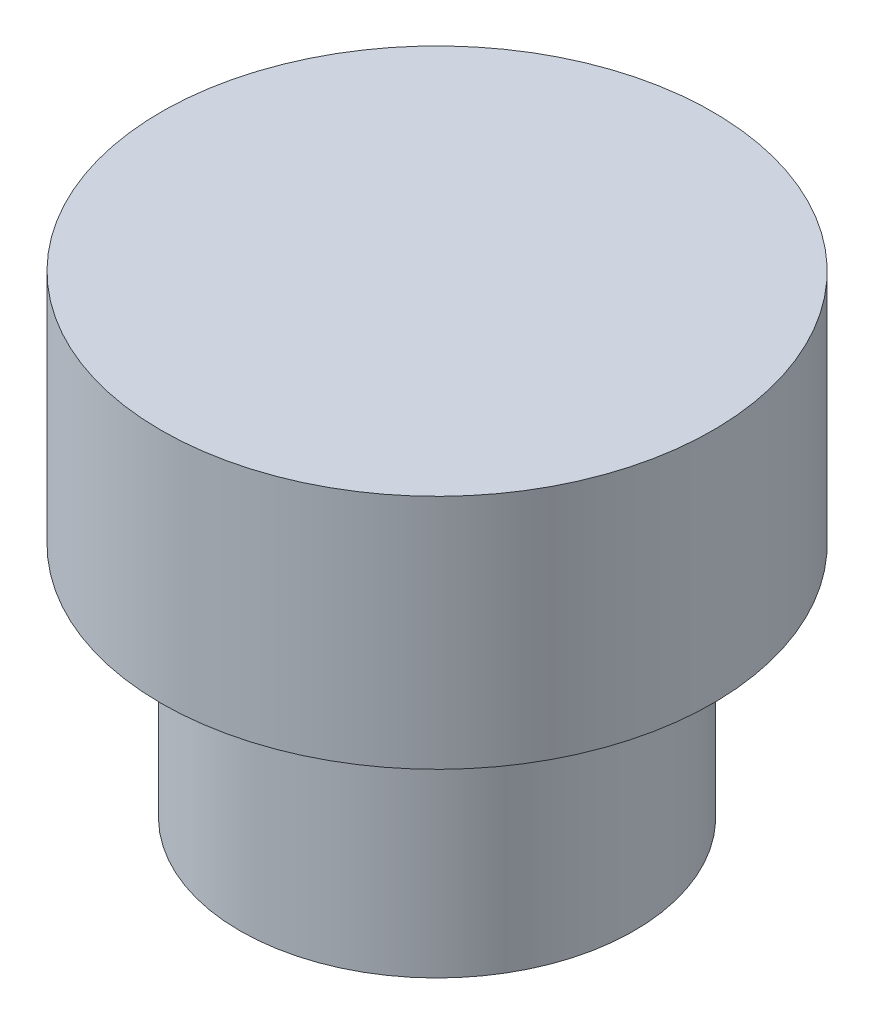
ISO-10303-21;
HEADER;
FILE_DESCRIPTION(('STEP AP214'),'2;1');
FILE_NAME('part.step','',(''),(''),'','','');
FILE_SCHEMA(('AUTOMOTIVE_DESIGN { 1 0 10303 214 1 1 1 1 }'));
ENDSEC;
DATA;
#1=APPLICATION_CONTEXT('core data for automotive mechanical design processes');
#2=APPLICATION_PROTOCOL_DEFINITION('international standard','automotive_design',2000,#1);
#3=PRODUCT_CONTEXT('',#1,'mechanical');
#4=PRODUCT('Part','Part','',(#3));
#5=PRODUCT_RELATED_PRODUCT_CATEGORY('part','',(#4));
#6=PRODUCT_DEFINITION_FORMATION('','',#4);
#7=PRODUCT_DEFINITION_CONTEXT('part definition',#1,'design');
#8=PRODUCT_DEFINITION('design','',#6,#7);
#9=PRODUCT_DEFINITION_SHAPE('','',#8);
#10=(LENGTH_UNIT() NAMED_UNIT(*) SI_UNIT(.MILLI.,.METRE.));
#11=(NAMED_UNIT(*) PLANE_ANGLE_UNIT() SI_UNIT($,.RADIAN.));
#12=(NAMED_UNIT(*) SI_UNIT($,.STERADIAN.) SOLID_ANGLE_UNIT());
#13=UNCERTAINTY_MEASURE_WITH_UNIT(LENGTH_MEASURE(1.E-05),#10,'distance_accuracy_value','');
#14=(GEOMETRIC_REPRESENTATION_CONTEXT(3) GLOBAL_UNCERTAINTY_ASSIGNED_CONTEXT((#13)) GLOBAL_UNIT_ASSIGNED_CONTEXT((#10,
#11,#12)) REPRESENTATION_CONTEXT('',''));
#15=CARTESIAN_POINT('',(0.,0.,0.));
#16=DIRECTION('',(0.,0.,1.));
#17=DIRECTION('',(1.,0.,0.));
#18=AXIS2_PLACEMENT_3D('',#15,#16,#17);
#19=CARTESIAN_POINT('',(0.,0.,0.));
#20=DIRECTION('',(0.,1.,0.));
#21=DIRECTION('',(0.,0.,1.));
#22=AXIS2_PLACEMENT_3D('',#19,#20,#21);
#23=PLANE('',#22);
#24=CARTESIAN_POINT('',(0.,0.,0.));
#25=DIRECTION('',(0.,1.,0.));
#26=DIRECTION('',(0.,0.,1.));
#27=AXIS2_PLACEMENT_3D('',#24,#25,#26);
#28=CIRCLE('',#27,1.75);
#29=CARTESIAN_POINT('',(0.,0.,1.75));
#30=VERTEX_POINT('',#29);
#31=EDGE_CURVE('E41',#30,#30,#28,.T.);
#32=ORIENTED_EDGE('',*,*,#31,.F.);
#33=EDGE_LOOP('',(#32));
#34=FACE_BOUND('',#33,.T.);
#35=CARTESIAN_POINT('',(0.,0.,0.));
#36=DIRECTION('',(0.,1.,0.));
#37=DIRECTION('',(0.,0.,1.));
#38=AXIS2_PLACEMENT_3D('',#35,#36,#37);
#39=CIRCLE('',#38,1.25);
#40=CARTESIAN_POINT('',(0.,0.,1.25));
#41=VERTEX_POINT('',#40);
#42=EDGE_CURVE('E10',#41,#41,#39,.F.);
#43=ORIENTED_EDGE('',*,*,#42,.F.);
#44=EDGE_LOOP('',(#43));
#45=FACE_BOUND('',#44,.T.);
#46=ADVANCED_FACE('F30',(#34,#45),#23,.F.);
#47=CARTESIAN_POINT('',(0.,1.5,0.));
#48=DIRECTION('',(0.,-1.,0.));
#49=DIRECTION('',(0.,0.,-1.));
#50=AXIS2_PLACEMENT_3D('',#47,#48,#49);
#51=CYLINDRICAL_SURFACE('',#50,1.75);
#52=CARTESIAN_POINT('',(0.,1.5,0.));
#53=DIRECTION('',(0.,1.,0.));
#54=DIRECTION('',(0.,0.,1.));
#55=AXIS2_PLACEMENT_3D('',#52,#53,#54);
#56=CIRCLE('',#55,1.75);
#57=CARTESIAN_POINT('',(0.,1.5,1.75));
#58=VERTEX_POINT('',#57);
#59=EDGE_CURVE('E37',#58,#58,#56,.T.);
#60=ORIENTED_EDGE('',*,*,#59,.F.);
#61=EDGE_LOOP('',(#60));
#62=FACE_BOUND('',#61,.T.);
#63=ORIENTED_EDGE('',*,*,#31,.T.);
#64=EDGE_LOOP('',(#63));
#65=FACE_BOUND('',#64,.T.);
#66=ADVANCED_FACE('F32',(#62,#65),#51,.T.);
#67=CARTESIAN_POINT('',(0.,1.5,0.));
#68=DIRECTION('',(0.,1.,0.));
#69=DIRECTION('',(0.,0.,1.));
#70=AXIS2_PLACEMENT_3D('',#67,#68,#69);
#71=PLANE('',#70);
#72=ORIENTED_EDGE('',*,*,#59,.T.);
#73=EDGE_LOOP('',(#72));
#74=FACE_BOUND('',#73,.T.);
#75=ADVANCED_FACE('F59',(#74),#71,.T.);
#76=CARTESIAN_POINT('',(0.,-5.03553390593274,0.));
#77=DIRECTION('',(0.,1.,0.));
#78=DIRECTION('',(0.,0.,1.));
#79=AXIS2_PLACEMENT_3D('',#76,#77,#78);
#80=CYLINDRICAL_SURFACE('',#79,1.25);
#81=CARTESIAN_POINT('',(0.,-1.5,0.));
#82=DIRECTION('',(0.,1.,0.));
#83=DIRECTION('',(0.,0.,1.));
#84=AXIS2_PLACEMENT_3D('',#81,#82,#83);
#85=CIRCLE('',#84,1.25);
#86=CARTESIAN_POINT('',(0.,-1.5,1.25));
#87=VERTEX_POINT('',#86);
#88=EDGE_CURVE('E45',#87,#87,#85,.T.);
#89=CARTESIAN_POINT('',(0.,-1.5,1.25));
#90=CARTESIAN_POINT('',(0.,-1.484375,1.25));
#91=CARTESIAN_POINT('',(0.,-1.46875,1.25));
#92=CARTESIAN_POINT('',(0.,-1.4375,1.25));
#93=CARTESIAN_POINT('',(0.,-1.421875,1.25));
#94=CARTESIAN_POINT('',(0.,-1.390625,1.25));
#95=CARTESIAN_POINT('',(0.,-1.375,1.25));
#96=CARTESIAN_POINT('',(0.,-1.34375,1.25));
#97=CARTESIAN_POINT('',(0.,-1.328125,1.25));
#98=CARTESIAN_POINT('',(0.,-1.296875,1.25));
#99=CARTESIAN_POINT('',(0.,-1.28125,1.25));
#100=CARTESIAN_POINT('',(0.,-1.25,1.25));
#101=CARTESIAN_POINT('',(0.,-1.234375,1.25));
#102=CARTESIAN_POINT('',(0.,-1.203125,1.25));
#103=CARTESIAN_POINT('',(0.,-1.1875,1.25));
#104=CARTESIAN_POINT('',(0.,-1.15625,1.25));
#105=CARTESIAN_POINT('',(0.,-1.140625,1.25));
#106=CARTESIAN_POINT('',(0.,-1.109375,1.25));
#107=CARTESIAN_POINT('',(0.,-1.09375,1.25));
#108=CARTESIAN_POINT('',(0.,-1.0625,1.25));
#109=CARTESIAN_POINT('',(0.,-1.046875,1.25));
#110=CARTESIAN_POINT('',(0.,-1.015625,1.25));
#111=CARTESIAN_POINT('',(0.,-1.,1.25));
#112=CARTESIAN_POINT('',(0.,-0.968750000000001,1.25));
#113=CARTESIAN_POINT('',(0.,-0.953125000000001,1.25));
#114=CARTESIAN_POINT('',(0.,-0.921875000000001,1.25));
#115=CARTESIAN_POINT('',(0.,-0.906250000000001,1.25));
#116=CARTESIAN_POINT('',(0.,-0.875000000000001,1.25));
#117=CARTESIAN_POINT('',(0.,-0.859375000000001,1.25));
#118=CARTESIAN_POINT('',(0.,-0.828125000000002,1.25));
#119=CARTESIAN_POINT('',(0.,-0.812500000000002,1.25));
#120=CARTESIAN_POINT('',(0.,-0.781250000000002,1.25));
#121=CARTESIAN_POINT('',(0.,-0.765625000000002,1.25));
#122=CARTESIAN_POINT('',(0.,-0.734375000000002,1.25));
#123=CARTESIAN_POINT('',(0.,-0.718750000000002,1.25));
#124=CARTESIAN_POINT('',(0.,-0.687500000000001,1.25));
#125=CARTESIAN_POINT('',(0.,-0.671875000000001,1.25));
#126=CARTESIAN_POINT('',(0.,-0.640625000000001,1.25));
#127=CARTESIAN_POINT('',(0.,-0.625000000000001,1.25));
#128=CARTESIAN_POINT('',(0.,-0.593750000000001,1.25));
#129=CARTESIAN_POINT('',(0.,-0.578125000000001,1.25));
#130=CARTESIAN_POINT('',(0.,-0.546875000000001,1.25));
#131=CARTESIAN_POINT('',(0.,-0.531250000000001,1.25));
#132=CARTESIAN_POINT('',(0.,-0.500000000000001,1.25));
#133=CARTESIAN_POINT('',(0.,-0.484375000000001,1.25));
#134=CARTESIAN_POINT('',(0.,-0.453125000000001,1.25));
#135=CARTESIAN_POINT('',(0.,-0.437500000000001,1.25));
#136=CARTESIAN_POINT('',(0.,-0.406250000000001,1.25));
#137=CARTESIAN_POINT('',(0.,-0.390625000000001,1.25));
#138=CARTESIAN_POINT('',(0.,-0.359375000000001,1.25));
#139=CARTESIAN_POINT('',(0.,-0.343750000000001,1.25));
#140=CARTESIAN_POINT('',(0.,-0.312500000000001,1.25));
#141=CARTESIAN_POINT('',(0.,-0.296875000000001,1.25));
#142=CARTESIAN_POINT('',(0.,-0.265625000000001,1.25));
#143=CARTESIAN_POINT('',(0.,-0.250000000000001,1.25));
#144=CARTESIAN_POINT('',(0.,-0.218750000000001,1.25));
#145=CARTESIAN_POINT('',(0.,-0.203125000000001,1.25));
#146=CARTESIAN_POINT('',(0.,-0.171875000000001,1.25));
#147=CARTESIAN_POINT('',(0.,-0.156250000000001,1.25));
#148=CARTESIAN_POINT('',(0.,-0.125000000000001,1.25));
#149=CARTESIAN_POINT('',(0.,-0.109375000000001,1.25));
#150=CARTESIAN_POINT('',(0.,-0.0781250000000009,1.25));
#151=CARTESIAN_POINT('',(0.,-0.0625000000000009,1.25));
#152=CARTESIAN_POINT('',(0.,-0.0312500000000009,1.25));
#153=CARTESIAN_POINT('',(0.,-0.0156250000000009,1.25));
#154=CARTESIAN_POINT('',(0.,0.,1.25));
#155=B_SPLINE_CURVE_WITH_KNOTS('',3,(#89,#90,#91,#92,#93,#94,#95,#96,#97,#98,#99,#100,#101,#102,
#103,#104,#105,#106,#107,#108,#109,#110,#111,#112,#113,#114,#115,#116,#117,#118,#119,#120,#121,
#122,#123,#124,#125,#126,#127,#128,#129,#130,#131,#132,#133,#134,#135,#136,#137,#138,#139,#140,
#141,#142,#143,#144,#145,#146,#147,#148,#149,#150,#151,#152,#153,#154),.UNSPECIFIED.,.F.,.F.,(4,
2,2,2,2,2,2,2,2,2,2,2,2,2,2,2,2,2,2,2,2,2,2,2,2,2,2,2,2,2,2,2,4),(0.,0.046875,
0.0937500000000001,0.140625,0.1875,0.234375,0.28125,0.328125,0.375,0.421875,0.46875,0.515625,
0.5625,0.609375,0.656249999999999,0.703124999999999,0.749999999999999,0.796874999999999,
0.843749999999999,0.890624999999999,0.9375,0.984375,1.03125,1.078125,1.125,1.171875,1.21875,
1.265625,1.3125,1.359375,1.40625,1.453125,1.5),.UNSPECIFIED.);
#156=EDGE_CURVE('BSEAM51',#87,#41,#155,.T.);
#157=ORIENTED_EDGE('',*,*,#88,.T.);
#158=ORIENTED_EDGE('',*,*,#42,.T.);
#159=ORIENTED_EDGE('',*,*,#156,.T.);
#160=ORIENTED_EDGE('',*,*,#156,.F.);
#161=EDGE_LOOP('',(#157,#159,#158,#160));
#162=FACE_BOUND('',#161,.T.);
#163=ADVANCED_FACE('F51',(#162),#80,.T.);
#164=CARTESIAN_POINT('',(7.50000000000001,-1.5,-25.));
#165=DIRECTION('',(0.,1.,0.));
#166=DIRECTION('',(0.,0.,-1.));
#167=AXIS2_PLACEMENT_3D('',#164,#165,#166);
#168=PLANE('',#167);
#169=ORIENTED_EDGE('',*,*,#88,.F.);
#170=EDGE_LOOP('',(#169));
#171=FACE_BOUND('',#170,.T.);
#172=ADVANCED_FACE('F53',(#171),#168,.F.);
#173=CLOSED_SHELL('',(#46,#66,#75,#163,#172));
#174=MANIFOLD_SOLID_BREP('B2',#173);
#175=ADVANCED_BREP_SHAPE_REPRESENTATION('',(#18,#174),#14);
#176=SHAPE_DEFINITION_REPRESENTATION(#9,#175);
ENDSEC;
END-ISO-10303-21;
